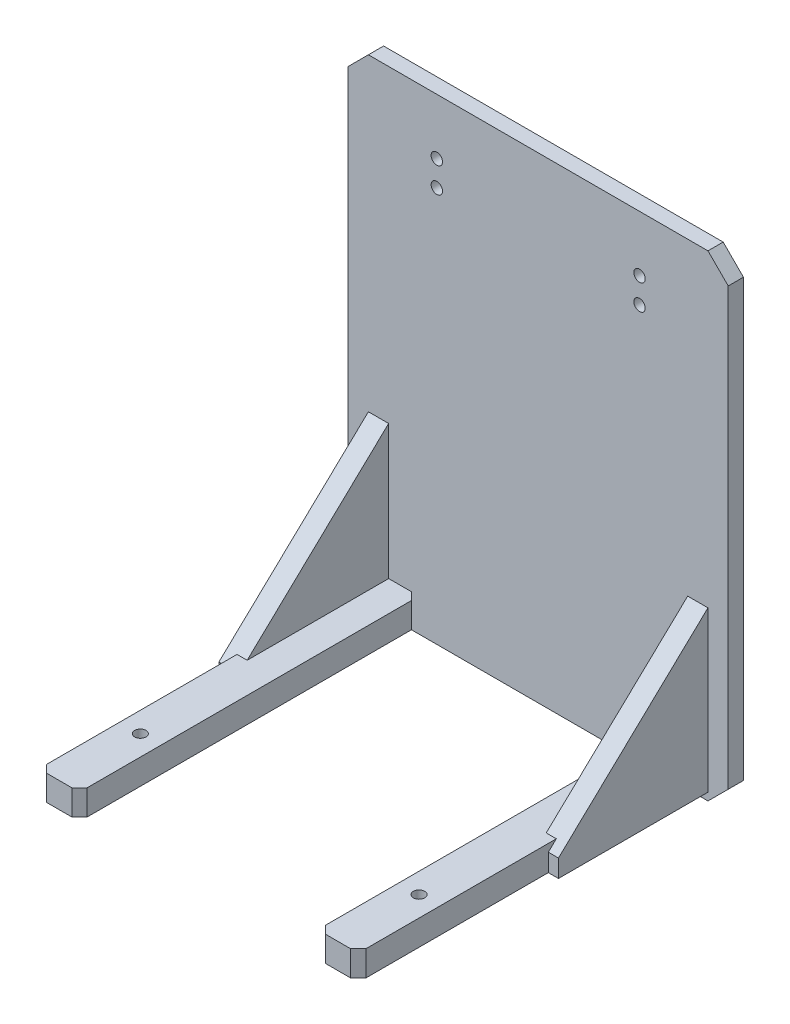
from build123d import *

# Parameters (mm, degrees)
SKETCH_1_R                              = 2.25
BASE_150X188X6_FOUR_M4_SHOE_HOLES_DEPTH = 6
FIXED_MASTS_M4_PITCH110_START           = -105
SKETCH_2_R                              = 2.25
FIXED_MASTS_M4_PITCH110_DEPTH           = 10
LEFT_GUSSET_START                       = -67
LEFT_GUSSET_DEPTH                       = 8
RIGHT_GUSSET_START                      = 59
RIGHT_GUSSET_DEPTH                      = 8


with BuildPart() as part:
    # Sketch 1 → Base_150x188x6_four_M4_shoe_holes (new body)
    with BuildSketch(Plane.XY):
        Polygon((-67, -108), (67, -108), (75, -100), (75, 72), (67, 80), (-67, 80), (-75, 72), (-75, -100), align=None)
        with Locations((-40, 48)):
            Circle(SKETCH_1_R, mode=Mode.SUBTRACT)
        with Locations((-40, 58)):
            Circle(SKETCH_1_R, mode=Mode.SUBTRACT)
        with Locations((40, 48)):
            Circle(SKETCH_1_R, mode=Mode.SUBTRACT)
        with Locations((40, 58)):
            Circle(SKETCH_1_R, mode=Mode.SUBTRACT)
    extrude(amount=BASE_150X188X6_FOUR_M4_SHOE_HOLES_DEPTH)

    # Sketch 2 → Fixed_masts_M4_pitch110 (add)
    # profile 1 of 2: a face of its own
    with BuildSketch(Plane(origin=(0, 0, 0), x_dir=(1, 0, 0), z_dir=(0, 1, 0)).offset(FIXED_MASTS_M4_PITCH110_START)):
        Polygon((-60, -6), (-50, -6), (-47, -9), (-47, -137), (-50, -140), (-60, -140), (-63, -137), (-63, -9), align=None)
        with Locations(Location((-55, -108, 0), (0, 0, 270))):
            Circle(SKETCH_2_R, mode=Mode.SUBTRACT)
    # profile 2 of 2: a face of its own
    with BuildSketch(Plane(origin=(0, 0, 0), x_dir=(1, 0, 0), z_dir=(0, 1, 0)).offset(FIXED_MASTS_M4_PITCH110_START)):
        Polygon((50, -6), (60, -6), (63, -9), (63, -137), (60, -140), (50, -140), (47, -137), (47, -9), align=None)
        with Locations(Location((55, -108, 0), (0, 0, 270))):
            Circle(SKETCH_2_R, mode=Mode.SUBTRACT)
    extrude(amount=FIXED_MASTS_M4_PITCH110_DEPTH)

    # Sketch 3 → Left_gusset (add)
    with BuildSketch(Plane(origin=(0, 0, 0), x_dir=(0, 0, -1), z_dir=(1, 0, 0)).offset(LEFT_GUSSET_START)):
        Polygon((-6, -105), (-6, -42), (-65, -98), (-65, -105), align=None)
    extrude(amount=LEFT_GUSSET_DEPTH)

    # Sketch 4 → Right_gusset (add)
    with BuildSketch(Plane(origin=(0, 0, 0), x_dir=(0, 0, -1), z_dir=(1, 0, 0)).offset(RIGHT_GUSSET_START)):
        Polygon((-6, -105), (-6, -42), (-65, -98), (-65, -105), align=None)
    extrude(amount=RIGHT_GUSSET_DEPTH)


solid = part.part
